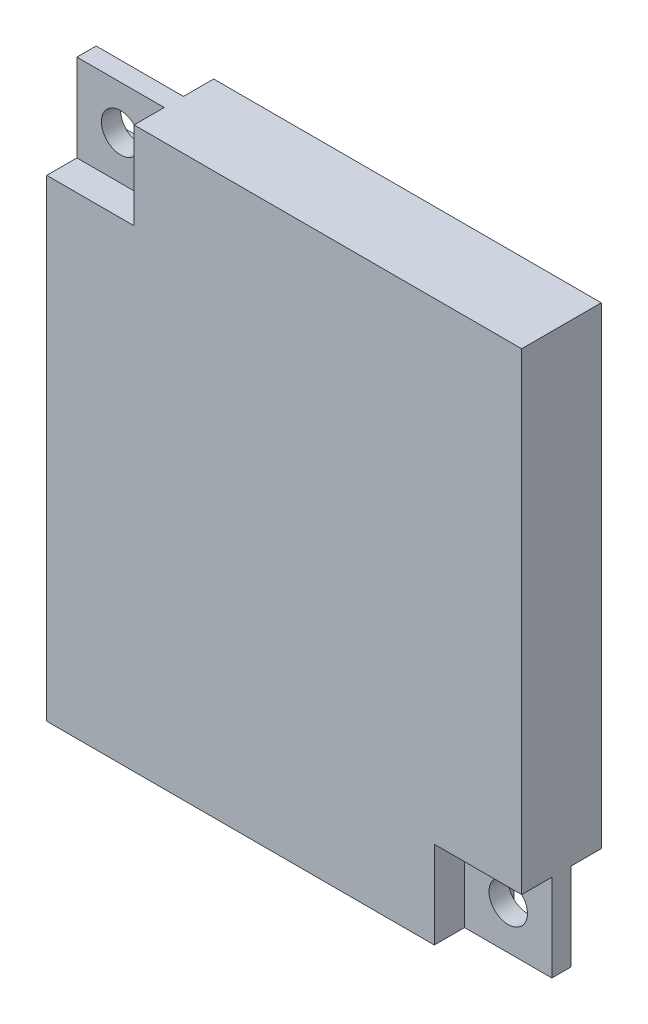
ISO-10303-21;
HEADER;
FILE_DESCRIPTION(('STEP AP214'),'2;1');
FILE_NAME('part.step','',(''),(''),'','','');
FILE_SCHEMA(('AUTOMOTIVE_DESIGN { 1 0 10303 214 1 1 1 1 }'));
ENDSEC;
DATA;
#1=APPLICATION_CONTEXT('core data for automotive mechanical design processes');
#2=APPLICATION_PROTOCOL_DEFINITION('international standard','automotive_design',2000,#1);
#3=PRODUCT_CONTEXT('',#1,'mechanical');
#4=PRODUCT('Part','Part','',(#3));
#5=PRODUCT_RELATED_PRODUCT_CATEGORY('part','',(#4));
#6=PRODUCT_DEFINITION_FORMATION('','',#4);
#7=PRODUCT_DEFINITION_CONTEXT('part definition',#1,'design');
#8=PRODUCT_DEFINITION('design','',#6,#7);
#9=PRODUCT_DEFINITION_SHAPE('','',#8);
#10=(LENGTH_UNIT() NAMED_UNIT(*) SI_UNIT(.MILLI.,.METRE.));
#11=(NAMED_UNIT(*) PLANE_ANGLE_UNIT() SI_UNIT($,.RADIAN.));
#12=(NAMED_UNIT(*) SI_UNIT($,.STERADIAN.) SOLID_ANGLE_UNIT());
#13=UNCERTAINTY_MEASURE_WITH_UNIT(LENGTH_MEASURE(1.E-05),#10,'distance_accuracy_value','');
#14=(GEOMETRIC_REPRESENTATION_CONTEXT(3) GLOBAL_UNCERTAINTY_ASSIGNED_CONTEXT((#13)) GLOBAL_UNIT_ASSIGNED_CONTEXT((#10,
#11,#12)) REPRESENTATION_CONTEXT('',''));
#15=CARTESIAN_POINT('',(0.,0.,0.));
#16=DIRECTION('',(0.,0.,1.));
#17=DIRECTION('',(1.,0.,0.));
#18=AXIS2_PLACEMENT_3D('',#15,#16,#17);
#19=CARTESIAN_POINT('',(0.,0.,0.));
#20=DIRECTION('',(0.,0.,1.));
#21=DIRECTION('',(1.,0.,0.));
#22=AXIS2_PLACEMENT_3D('',#19,#20,#21);
#23=PLANE('',#22);
#24=DIRECTION('',(-1.,0.,0.));
#25=VECTOR('',#24,1.);
#26=CARTESIAN_POINT('',(-21.971,10.5156,0.));
#27=LINE('',#26,#25);
#28=CARTESIAN_POINT('',(-17.78,10.5156,0.));
#29=VERTEX_POINT('',#28);
#30=CARTESIAN_POINT('',(-21.971,10.5156,0.));
#31=VERTEX_POINT('',#30);
#32=EDGE_CURVE('E231',#29,#31,#27,.T.);
#33=ORIENTED_EDGE('',*,*,#32,.F.);
#34=DIRECTION('',(0.,1.,0.));
#35=VECTOR('',#34,1.);
#36=CARTESIAN_POINT('',(-17.78,10.5156,0.));
#37=LINE('',#36,#35);
#38=CARTESIAN_POINT('',(-17.78,0.,0.));
#39=VERTEX_POINT('',#38);
#40=EDGE_CURVE('E225',#39,#29,#37,.T.);
#41=ORIENTED_EDGE('',*,*,#40,.F.);
#42=DIRECTION('',(1.,0.,0.));
#43=VECTOR('',#42,1.);
#44=CARTESIAN_POINT('',(0.,0.,0.));
#45=LINE('',#44,#43);
#46=CARTESIAN_POINT('',(-21.971,0.,0.));
#47=VERTEX_POINT('',#46);
#48=EDGE_CURVE('E340',#47,#39,#45,.T.);
#49=ORIENTED_EDGE('',*,*,#48,.F.);
#50=DIRECTION('',(0.,-1.,0.));
#51=VECTOR('',#50,1.);
#52=CARTESIAN_POINT('',(-21.971,0.,0.));
#53=LINE('',#52,#51);
#54=EDGE_CURVE('E353',#31,#47,#53,.T.);
#55=ORIENTED_EDGE('',*,*,#54,.F.);
#56=EDGE_LOOP('',(#33,#41,#49,#55));
#57=FACE_BOUND('',#56,.T.);
#58=DIRECTION('',(0.,1.,0.));
#59=VECTOR('',#58,1.);
#60=CARTESIAN_POINT('',(-21.336,2.032,0.));
#61=LINE('',#60,#59);
#62=CARTESIAN_POINT('',(-21.336,2.032,0.));
#63=VERTEX_POINT('',#62);
#64=CARTESIAN_POINT('',(-21.336,10.033,0.));
#65=VERTEX_POINT('',#64);
#66=EDGE_CURVE('E181',#63,#65,#61,.T.);
#67=ORIENTED_EDGE('',*,*,#66,.F.);
#68=DIRECTION('',(-1.,0.,0.));
#69=VECTOR('',#68,1.);
#70=CARTESIAN_POINT('',(-21.336,2.032,0.));
#71=LINE('',#70,#69);
#72=CARTESIAN_POINT('',(-18.3134,2.032,0.));
#73=VERTEX_POINT('',#72);
#74=EDGE_CURVE('E183',#73,#63,#71,.T.);
#75=ORIENTED_EDGE('',*,*,#74,.F.);
#76=DIRECTION('',(0.,-1.,0.));
#77=VECTOR('',#76,1.);
#78=CARTESIAN_POINT('',(-18.3134,2.032,0.));
#79=LINE('',#78,#77);
#80=CARTESIAN_POINT('',(-18.3134,10.033,0.));
#81=VERTEX_POINT('',#80);
#82=EDGE_CURVE('E51',#81,#73,#79,.T.);
#83=ORIENTED_EDGE('',*,*,#82,.F.);
#84=DIRECTION('',(1.,0.,0.));
#85=VECTOR('',#84,1.);
#86=CARTESIAN_POINT('',(-21.336,10.033,0.));
#87=LINE('',#86,#85);
#88=EDGE_CURVE('E46',#65,#81,#87,.T.);
#89=ORIENTED_EDGE('',*,*,#88,.F.);
#90=EDGE_LOOP('',(#67,#75,#83,#89));
#91=FACE_BOUND('',#90,.T.);
#92=ADVANCED_FACE('F29',(#57,#91),#23,.F.);
#93=CARTESIAN_POINT('',(-2.0193,2.0193,0.));
#94=DIRECTION('',(0.,0.,1.));
#95=DIRECTION('',(1.,0.,0.));
#96=AXIS2_PLACEMENT_3D('',#93,#94,#95);
#97=CIRCLE('',#96,0.889);
#98=CARTESIAN_POINT('',(-1.1303,2.0193,0.));
#99=VERTEX_POINT('',#98);
#100=EDGE_CURVE('E216',#99,#99,#97,.T.);
#101=ORIENTED_EDGE('',*,*,#100,.T.);
#102=EDGE_LOOP('',(#101));
#103=FACE_BOUND('',#102,.T.);
#104=DIRECTION('',(0.,-1.,0.));
#105=VECTOR('',#104,1.);
#106=CARTESIAN_POINT('',(-4.0386,0.,0.));
#107=LINE('',#106,#105);
#108=CARTESIAN_POINT('',(-4.0386,4.0386,0.));
#109=VERTEX_POINT('',#108);
#110=CARTESIAN_POINT('',(-4.03859999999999,0.,0.));
#111=VERTEX_POINT('',#110);
#112=EDGE_CURVE('E278',#109,#111,#107,.T.);
#113=ORIENTED_EDGE('',*,*,#112,.F.);
#114=DIRECTION('',(-1.,0.,0.));
#115=VECTOR('',#114,1.);
#116=CARTESIAN_POINT('',(-4.0386,4.0386,0.));
#117=LINE('',#116,#115);
#118=CARTESIAN_POINT('',(0.,4.0386,0.));
#119=VERTEX_POINT('',#118);
#120=EDGE_CURVE('E268',#119,#109,#117,.T.);
#121=ORIENTED_EDGE('',*,*,#120,.F.);
#122=DIRECTION('',(0.,1.,0.));
#123=VECTOR('',#122,1.);
#124=CARTESIAN_POINT('',(0.,0.,0.));
#125=LINE('',#124,#123);
#126=CARTESIAN_POINT('',(0.,0.,0.));
#127=VERTEX_POINT('',#126);
#128=EDGE_CURVE('E334',#127,#119,#125,.T.);
#129=ORIENTED_EDGE('',*,*,#128,.F.);
#130=EDGE_CURVE('E465',#111,#127,#45,.T.);
#131=ORIENTED_EDGE('',*,*,#130,.F.);
#132=EDGE_LOOP('',(#113,#121,#129,#131));
#133=FACE_BOUND('',#132,.T.);
#134=ADVANCED_FACE('F488',(#103,#133),#23,.F.);
#135=CARTESIAN_POINT('',(-19.9517,23.8887,0.));
#136=DIRECTION('',(0.,0.,1.));
#137=DIRECTION('',(1.,0.,0.));
#138=AXIS2_PLACEMENT_3D('',#135,#136,#137);
#139=CIRCLE('',#138,0.889);
#140=CARTESIAN_POINT('',(-19.0627,23.8887,0.));
#141=VERTEX_POINT('',#140);
#142=EDGE_CURVE('E222',#141,#141,#139,.T.);
#143=ORIENTED_EDGE('',*,*,#142,.T.);
#144=EDGE_LOOP('',(#143));
#145=FACE_BOUND('',#144,.T.);
#146=DIRECTION('',(0.,1.,0.));
#147=VECTOR('',#146,1.);
#148=CARTESIAN_POINT('',(-17.9324,25.908,0.));
#149=LINE('',#148,#147);
#150=CARTESIAN_POINT('',(-17.9324,21.8694,0.));
#151=VERTEX_POINT('',#150);
#152=CARTESIAN_POINT('',(-17.9324,25.908,0.));
#153=VERTEX_POINT('',#152);
#154=EDGE_CURVE('E260',#151,#153,#149,.T.);
#155=ORIENTED_EDGE('',*,*,#154,.F.);
#156=DIRECTION('',(1.,0.,0.));
#157=VECTOR('',#156,1.);
#158=CARTESIAN_POINT('',(-17.9324,21.8694,0.));
#159=LINE('',#158,#157);
#160=CARTESIAN_POINT('',(-21.971,21.8694,0.));
#161=VERTEX_POINT('',#160);
#162=EDGE_CURVE('E234',#161,#151,#159,.T.);
#163=ORIENTED_EDGE('',*,*,#162,.F.);
#164=CARTESIAN_POINT('',(-21.971,25.908,0.));
#165=VERTEX_POINT('',#164);
#166=EDGE_CURVE('E461',#165,#161,#53,.T.);
#167=ORIENTED_EDGE('',*,*,#166,.F.);
#168=DIRECTION('',(-1.,0.,0.));
#169=VECTOR('',#168,1.);
#170=CARTESIAN_POINT('',(0.,25.908,0.));
#171=LINE('',#170,#169);
#172=EDGE_CURVE('E338',#153,#165,#171,.T.);
#173=ORIENTED_EDGE('',*,*,#172,.F.);
#174=EDGE_LOOP('',(#155,#163,#167,#173));
#175=FACE_BOUND('',#174,.T.);
#176=ADVANCED_FACE('F464',(#145,#175),#23,.F.);
#177=CARTESIAN_POINT('',(0.,0.,0.889));
#178=DIRECTION('',(0.,0.,1.));
#179=DIRECTION('',(1.,0.,0.));
#180=AXIS2_PLACEMENT_3D('',#177,#178,#179);
#181=PLANE('',#180);
#182=CARTESIAN_POINT('',(-2.0193,2.0193,0.889));
#183=DIRECTION('',(0.,0.,1.));
#184=DIRECTION('',(1.,0.,0.));
#185=AXIS2_PLACEMENT_3D('',#182,#183,#184);
#186=CIRCLE('',#185,0.889);
#187=CARTESIAN_POINT('',(-1.1303,2.0193,0.889));
#188=VERTEX_POINT('',#187);
#189=EDGE_CURVE('E213',#188,#188,#186,.T.);
#190=ORIENTED_EDGE('',*,*,#189,.F.);
#191=EDGE_LOOP('',(#190));
#192=FACE_BOUND('',#191,.T.);
#193=DIRECTION('',(1.,0.,0.));
#194=VECTOR('',#193,1.);
#195=CARTESIAN_POINT('',(-4.0386,4.0386,0.889));
#196=LINE('',#195,#194);
#197=CARTESIAN_POINT('',(-4.0386,4.0386,0.889));
#198=VERTEX_POINT('',#197);
#199=CARTESIAN_POINT('',(0.,4.0386,0.889));
#200=VERTEX_POINT('',#199);
#201=EDGE_CURVE('E377',#198,#200,#196,.T.);
#202=ORIENTED_EDGE('',*,*,#201,.F.);
#203=DIRECTION('',(0.,1.,0.));
#204=VECTOR('',#203,1.);
#205=CARTESIAN_POINT('',(-4.0386,0.,0.889));
#206=LINE('',#205,#204);
#207=CARTESIAN_POINT('',(-4.0386,0.,0.889));
#208=VERTEX_POINT('',#207);
#209=EDGE_CURVE('E323',#208,#198,#206,.T.);
#210=ORIENTED_EDGE('',*,*,#209,.F.);
#211=DIRECTION('',(1.,0.,0.));
#212=VECTOR('',#211,1.);
#213=CARTESIAN_POINT('',(0.,0.,0.889));
#214=LINE('',#213,#212);
#215=CARTESIAN_POINT('',(0.,0.,0.889));
#216=VERTEX_POINT('',#215);
#217=EDGE_CURVE('E369',#208,#216,#214,.T.);
#218=ORIENTED_EDGE('',*,*,#217,.T.);
#219=DIRECTION('',(0.,1.,0.));
#220=VECTOR('',#219,1.);
#221=CARTESIAN_POINT('',(0.,0.,0.889));
#222=LINE('',#221,#220);
#223=EDGE_CURVE('E474',#216,#200,#222,.T.);
#224=ORIENTED_EDGE('',*,*,#223,.T.);
#225=EDGE_LOOP('',(#202,#210,#218,#224));
#226=FACE_BOUND('',#225,.T.);
#227=ADVANCED_FACE('F484',(#192,#226),#181,.T.);
#228=CARTESIAN_POINT('',(0.,0.,0.889));
#229=DIRECTION('',(-1.,0.,0.));
#230=DIRECTION('',(0.,0.,1.));
#231=AXIS2_PLACEMENT_3D('',#228,#229,#230);
#232=PLANE('',#231);
#233=ORIENTED_EDGE('',*,*,#128,.T.);
#234=DIRECTION('',(0.,0.,1.));
#235=VECTOR('',#234,1.);
#236=CARTESIAN_POINT('',(0.,4.0386,-1.397));
#237=LINE('',#236,#235);
#238=CARTESIAN_POINT('',(0.,4.0386,-1.397));
#239=VERTEX_POINT('',#238);
#240=EDGE_CURVE('E265',#239,#119,#237,.T.);
#241=ORIENTED_EDGE('',*,*,#240,.F.);
#242=DIRECTION('',(0.,-1.,0.));
#243=VECTOR('',#242,1.);
#244=CARTESIAN_POINT('',(0.,4.0386,-1.397));
#245=LINE('',#244,#243);
#246=CARTESIAN_POINT('',(0.,25.908,-1.397));
#247=VERTEX_POINT('',#246);
#248=EDGE_CURVE('E307',#247,#239,#245,.T.);
#249=ORIENTED_EDGE('',*,*,#248,.F.);
#250=DIRECTION('',(0.,0.,-1.));
#251=VECTOR('',#250,1.);
#252=CARTESIAN_POINT('',(0.,25.908,0.889));
#253=LINE('',#252,#251);
#254=CARTESIAN_POINT('',(0.,25.908,2.286));
#255=VERTEX_POINT('',#254);
#256=EDGE_CURVE('E11',#255,#247,#253,.T.);
#257=ORIENTED_EDGE('',*,*,#256,.F.);
#258=DIRECTION('',(0.,1.,0.));
#259=VECTOR('',#258,1.);
#260=CARTESIAN_POINT('',(0.,4.0386,2.286));
#261=LINE('',#260,#259);
#262=CARTESIAN_POINT('',(0.,4.0386,2.286));
#263=VERTEX_POINT('',#262);
#264=EDGE_CURVE('E385',#263,#255,#261,.T.);
#265=ORIENTED_EDGE('',*,*,#264,.F.);
#266=DIRECTION('',(0.,0.,-1.));
#267=VECTOR('',#266,1.);
#268=CARTESIAN_POINT('',(0.,4.0386,2.286));
#269=LINE('',#268,#267);
#270=EDGE_CURVE('E381',#263,#200,#269,.T.);
#271=ORIENTED_EDGE('',*,*,#270,.T.);
#272=ORIENTED_EDGE('',*,*,#223,.F.);
#273=DIRECTION('',(0.,0.,-1.));
#274=VECTOR('',#273,1.);
#275=CARTESIAN_POINT('',(0.,0.,0.889));
#276=LINE('',#275,#274);
#277=EDGE_CURVE('E479',#216,#127,#276,.T.);
#278=ORIENTED_EDGE('',*,*,#277,.T.);
#279=EDGE_LOOP('',(#233,#241,#249,#257,#265,#271,#272,#278));
#280=FACE_BOUND('',#279,.T.);
#281=ADVANCED_FACE('F31',(#280),#232,.F.);
#282=CARTESIAN_POINT('',(0.,25.908,0.889));
#283=DIRECTION('',(0.,-1.,0.));
#284=DIRECTION('',(1.,0.,0.));
#285=AXIS2_PLACEMENT_3D('',#282,#283,#284);
#286=PLANE('',#285);
#287=ORIENTED_EDGE('',*,*,#256,.T.);
#288=DIRECTION('',(1.,0.,0.));
#289=VECTOR('',#288,1.);
#290=CARTESIAN_POINT('',(0.,25.908,-1.397));
#291=LINE('',#290,#289);
#292=CARTESIAN_POINT('',(-17.9324,25.908,-1.397));
#293=VERTEX_POINT('',#292);
#294=EDGE_CURVE('E304',#293,#247,#291,.T.);
#295=ORIENTED_EDGE('',*,*,#294,.F.);
#296=DIRECTION('',(0.,0.,1.));
#297=VECTOR('',#296,1.);
#298=CARTESIAN_POINT('',(-17.9324,25.908,-1.397));
#299=LINE('',#298,#297);
#300=EDGE_CURVE('E254',#293,#153,#299,.T.);
#301=ORIENTED_EDGE('',*,*,#300,.T.);
#302=ORIENTED_EDGE('',*,*,#172,.T.);
#303=DIRECTION('',(0.,0.,-1.));
#304=VECTOR('',#303,1.);
#305=CARTESIAN_POINT('',(-21.971,25.908,0.889));
#306=LINE('',#305,#304);
#307=CARTESIAN_POINT('',(-21.971,25.908,0.889));
#308=VERTEX_POINT('',#307);
#309=EDGE_CURVE('E38',#308,#165,#306,.T.);
#310=ORIENTED_EDGE('',*,*,#309,.F.);
#311=DIRECTION('',(-1.,0.,0.));
#312=VECTOR('',#311,1.);
#313=CARTESIAN_POINT('',(0.,25.908,0.889));
#314=LINE('',#313,#312);
#315=CARTESIAN_POINT('',(-17.9324,25.908,0.889));
#316=VERTEX_POINT('',#315);
#317=EDGE_CURVE('E424',#316,#308,#314,.T.);
#318=ORIENTED_EDGE('',*,*,#317,.F.);
#319=DIRECTION('',(0.,0.,-1.));
#320=VECTOR('',#319,1.);
#321=CARTESIAN_POINT('',(-17.9324,25.908,2.286));
#322=LINE('',#321,#320);
#323=CARTESIAN_POINT('',(-17.9324,25.908,2.286));
#324=VERTEX_POINT('',#323);
#325=EDGE_CURVE('E339',#324,#316,#322,.T.);
#326=ORIENTED_EDGE('',*,*,#325,.F.);
#327=DIRECTION('',(-1.,0.,0.));
#328=VECTOR('',#327,1.);
#329=CARTESIAN_POINT('',(0.,25.908,2.286));
#330=LINE('',#329,#328);
#331=EDGE_CURVE('E380',#255,#324,#330,.T.);
#332=ORIENTED_EDGE('',*,*,#331,.F.);
#333=EDGE_LOOP('',(#287,#295,#301,#302,#310,#318,#326,#332));
#334=FACE_BOUND('',#333,.T.);
#335=ADVANCED_FACE('F422',(#334),#286,.F.);
#336=CARTESIAN_POINT('',(-21.971,0.,0.889));
#337=DIRECTION('',(1.,0.,0.));
#338=DIRECTION('',(0.,0.,-1.));
#339=AXIS2_PLACEMENT_3D('',#336,#337,#338);
#340=PLANE('',#339);
#341=ORIENTED_EDGE('',*,*,#166,.T.);
#342=DIRECTION('',(0.,0.,1.));
#343=VECTOR('',#342,1.);
#344=CARTESIAN_POINT('',(-21.971,21.8694,-1.397));
#345=LINE('',#344,#343);
#346=CARTESIAN_POINT('',(-21.971,21.8694,-1.397));
#347=VERTEX_POINT('',#346);
#348=EDGE_CURVE('E240',#347,#161,#345,.T.);
#349=ORIENTED_EDGE('',*,*,#348,.F.);
#350=DIRECTION('',(0.,1.,0.));
#351=VECTOR('',#350,1.);
#352=CARTESIAN_POINT('',(-21.971,21.8694,-1.397));
#353=LINE('',#352,#351);
#354=CARTESIAN_POINT('',(-21.971,10.5156,-1.397));
#355=VERTEX_POINT('',#354);
#356=EDGE_CURVE('E298',#355,#347,#353,.T.);
#357=ORIENTED_EDGE('',*,*,#356,.F.);
#358=DIRECTION('',(0.,0.,1.));
#359=VECTOR('',#358,1.);
#360=CARTESIAN_POINT('',(-21.971,10.5156,-1.397));
#361=LINE('',#360,#359);
#362=EDGE_CURVE('E237',#355,#31,#361,.T.);
#363=ORIENTED_EDGE('',*,*,#362,.T.);
#364=ORIENTED_EDGE('',*,*,#54,.T.);
#365=DIRECTION('',(0.,0.,-1.));
#366=VECTOR('',#365,1.);
#367=CARTESIAN_POINT('',(-21.971,0.,0.889));
#368=LINE('',#367,#366);
#369=CARTESIAN_POINT('',(-21.971,0.,2.286));
#370=VERTEX_POINT('',#369);
#371=EDGE_CURVE('E436',#370,#47,#368,.T.);
#372=ORIENTED_EDGE('',*,*,#371,.F.);
#373=DIRECTION('',(0.,-1.,0.));
#374=VECTOR('',#373,1.);
#375=CARTESIAN_POINT('',(-21.971,21.8694,2.286));
#376=LINE('',#375,#374);
#377=CARTESIAN_POINT('',(-21.971,21.8694,2.286));
#378=VERTEX_POINT('',#377);
#379=EDGE_CURVE('E408',#378,#370,#376,.T.);
#380=ORIENTED_EDGE('',*,*,#379,.F.);
#381=DIRECTION('',(0.,0.,-1.));
#382=VECTOR('',#381,1.);
#383=CARTESIAN_POINT('',(-21.971,21.8694,2.286));
#384=LINE('',#383,#382);
#385=CARTESIAN_POINT('',(-21.971,21.8694,0.889));
#386=VERTEX_POINT('',#385);
#387=EDGE_CURVE('E327',#378,#386,#384,.T.);
#388=ORIENTED_EDGE('',*,*,#387,.T.);
#389=DIRECTION('',(0.,-1.,0.));
#390=VECTOR('',#389,1.);
#391=CARTESIAN_POINT('',(-21.971,0.,0.889));
#392=LINE('',#391,#390);
#393=EDGE_CURVE('E462',#308,#386,#392,.T.);
#394=ORIENTED_EDGE('',*,*,#393,.F.);
#395=ORIENTED_EDGE('',*,*,#309,.T.);
#396=EDGE_LOOP('',(#341,#349,#357,#363,#364,#372,#380,#388,#394,#395));
#397=FACE_BOUND('',#396,.T.);
#398=ADVANCED_FACE('F460',(#397),#340,.F.);
#399=CARTESIAN_POINT('',(0.,0.,0.889));
#400=DIRECTION('',(0.,1.,0.));
#401=DIRECTION('',(-1.,0.,0.));
#402=AXIS2_PLACEMENT_3D('',#399,#400,#401);
#403=PLANE('',#402);
#404=ORIENTED_EDGE('',*,*,#48,.T.);
#405=DIRECTION('',(0.,0.,1.));
#406=VECTOR('',#405,1.);
#407=CARTESIAN_POINT('',(-17.78,0.,-1.397));
#408=LINE('',#407,#406);
#409=CARTESIAN_POINT('',(-17.78,0.,-1.397));
#410=VERTEX_POINT('',#409);
#411=EDGE_CURVE('E245',#410,#39,#408,.T.);
#412=ORIENTED_EDGE('',*,*,#411,.F.);
#413=DIRECTION('',(-1.,0.,0.));
#414=VECTOR('',#413,1.);
#415=CARTESIAN_POINT('',(-17.78,0.,-1.397));
#416=LINE('',#415,#414);
#417=CARTESIAN_POINT('',(-4.0386,0.,-1.397));
#418=VERTEX_POINT('',#417);
#419=EDGE_CURVE('E287',#418,#410,#416,.T.);
#420=ORIENTED_EDGE('',*,*,#419,.F.);
#421=DIRECTION('',(0.,0.,1.));
#422=VECTOR('',#421,1.);
#423=CARTESIAN_POINT('',(-4.0386,0.,-1.397));
#424=LINE('',#423,#422);
#425=EDGE_CURVE('E281',#418,#111,#424,.T.);
#426=ORIENTED_EDGE('',*,*,#425,.T.);
#427=ORIENTED_EDGE('',*,*,#130,.T.);
#428=ORIENTED_EDGE('',*,*,#277,.F.);
#429=ORIENTED_EDGE('',*,*,#217,.F.);
#430=DIRECTION('',(0.,0.,-1.));
#431=VECTOR('',#430,1.);
#432=CARTESIAN_POINT('',(-4.0386,0.,2.286));
#433=LINE('',#432,#431);
#434=CARTESIAN_POINT('',(-4.0386,0.,2.286));
#435=VERTEX_POINT('',#434);
#436=EDGE_CURVE('E331',#435,#208,#433,.T.);
#437=ORIENTED_EDGE('',*,*,#436,.F.);
#438=DIRECTION('',(1.,0.,0.));
#439=VECTOR('',#438,1.);
#440=CARTESIAN_POINT('',(-21.971,0.,2.286));
#441=LINE('',#440,#439);
#442=EDGE_CURVE('E406',#370,#435,#441,.T.);
#443=ORIENTED_EDGE('',*,*,#442,.F.);
#444=ORIENTED_EDGE('',*,*,#371,.T.);
#445=EDGE_LOOP('',(#404,#412,#420,#426,#427,#428,#429,#437,#443,#444));
#446=FACE_BOUND('',#445,.T.);
#447=ADVANCED_FACE('F435',(#446),#403,.F.);
#448=CARTESIAN_POINT('',(-19.9517,23.8887,0.889));
#449=DIRECTION('',(0.,0.,1.));
#450=DIRECTION('',(1.,0.,0.));
#451=AXIS2_PLACEMENT_3D('',#448,#449,#450);
#452=CIRCLE('',#451,0.889);
#453=CARTESIAN_POINT('',(-19.0627,23.8887,0.889));
#454=VERTEX_POINT('',#453);
#455=EDGE_CURVE('E219',#454,#454,#452,.T.);
#456=ORIENTED_EDGE('',*,*,#455,.F.);
#457=EDGE_LOOP('',(#456));
#458=FACE_BOUND('',#457,.T.);
#459=DIRECTION('',(-1.,0.,0.));
#460=VECTOR('',#459,1.);
#461=CARTESIAN_POINT('',(-17.9324,21.8694,0.889));
#462=LINE('',#461,#460);
#463=CARTESIAN_POINT('',(-17.9324,21.8694,0.889));
#464=VERTEX_POINT('',#463);
#465=EDGE_CURVE('E319',#464,#386,#462,.T.);
#466=ORIENTED_EDGE('',*,*,#465,.F.);
#467=DIRECTION('',(0.,-1.,0.));
#468=VECTOR('',#467,1.);
#469=CARTESIAN_POINT('',(-17.9324,25.908,0.889));
#470=LINE('',#469,#468);
#471=EDGE_CURVE('E324',#316,#464,#470,.T.);
#472=ORIENTED_EDGE('',*,*,#471,.F.);
#473=ORIENTED_EDGE('',*,*,#317,.T.);
#474=ORIENTED_EDGE('',*,*,#393,.T.);
#475=EDGE_LOOP('',(#466,#472,#473,#474));
#476=FACE_BOUND('',#475,.T.);
#477=ADVANCED_FACE('F527',(#458,#476),#181,.T.);
#478=CARTESIAN_POINT('',(-17.9324,25.908,2.286));
#479=DIRECTION('',(1.,0.,0.));
#480=DIRECTION('',(0.,0.,-1.));
#481=AXIS2_PLACEMENT_3D('',#478,#479,#480);
#482=PLANE('',#481);
#483=ORIENTED_EDGE('',*,*,#471,.T.);
#484=DIRECTION('',(0.,0.,-1.));
#485=VECTOR('',#484,1.);
#486=CARTESIAN_POINT('',(-17.9324,21.8694,2.286));
#487=LINE('',#486,#485);
#488=CARTESIAN_POINT('',(-17.9324,21.8694,2.286));
#489=VERTEX_POINT('',#488);
#490=EDGE_CURVE('E330',#489,#464,#487,.T.);
#491=ORIENTED_EDGE('',*,*,#490,.F.);
#492=DIRECTION('',(0.,-1.,0.));
#493=VECTOR('',#492,1.);
#494=CARTESIAN_POINT('',(-17.9324,25.908,2.286));
#495=LINE('',#494,#493);
#496=EDGE_CURVE('E413',#324,#489,#495,.T.);
#497=ORIENTED_EDGE('',*,*,#496,.F.);
#498=ORIENTED_EDGE('',*,*,#325,.T.);
#499=EDGE_LOOP('',(#483,#491,#497,#498));
#500=FACE_BOUND('',#499,.T.);
#501=ADVANCED_FACE('F425',(#500),#482,.F.);
#502=CARTESIAN_POINT('',(-17.9324,21.8694,2.286));
#503=DIRECTION('',(0.,-1.,0.));
#504=DIRECTION('',(0.,0.,-1.));
#505=AXIS2_PLACEMENT_3D('',#502,#503,#504);
#506=PLANE('',#505);
#507=ORIENTED_EDGE('',*,*,#465,.T.);
#508=ORIENTED_EDGE('',*,*,#387,.F.);
#509=DIRECTION('',(-1.,0.,0.));
#510=VECTOR('',#509,1.);
#511=CARTESIAN_POINT('',(-17.9324,21.8694,2.286));
#512=LINE('',#511,#510);
#513=EDGE_CURVE('E411',#489,#378,#512,.T.);
#514=ORIENTED_EDGE('',*,*,#513,.F.);
#515=ORIENTED_EDGE('',*,*,#490,.T.);
#516=EDGE_LOOP('',(#507,#508,#514,#515));
#517=FACE_BOUND('',#516,.T.);
#518=ADVANCED_FACE('F429',(#517),#506,.F.);
#519=CARTESIAN_POINT('',(-4.0386,0.,2.286));
#520=DIRECTION('',(-1.,0.,0.));
#521=DIRECTION('',(0.,0.,1.));
#522=AXIS2_PLACEMENT_3D('',#519,#520,#521);
#523=PLANE('',#522);
#524=ORIENTED_EDGE('',*,*,#209,.T.);
#525=DIRECTION('',(0.,0.,-1.));
#526=VECTOR('',#525,1.);
#527=CARTESIAN_POINT('',(-4.0386,4.0386,2.286));
#528=LINE('',#527,#526);
#529=CARTESIAN_POINT('',(-4.0386,4.0386,2.286));
#530=VERTEX_POINT('',#529);
#531=EDGE_CURVE('E384',#530,#198,#528,.T.);
#532=ORIENTED_EDGE('',*,*,#531,.F.);
#533=DIRECTION('',(0.,1.,0.));
#534=VECTOR('',#533,1.);
#535=CARTESIAN_POINT('',(-4.0386,0.,2.286));
#536=LINE('',#535,#534);
#537=EDGE_CURVE('E404',#435,#530,#536,.T.);
#538=ORIENTED_EDGE('',*,*,#537,.F.);
#539=ORIENTED_EDGE('',*,*,#436,.T.);
#540=EDGE_LOOP('',(#524,#532,#538,#539));
#541=FACE_BOUND('',#540,.T.);
#542=ADVANCED_FACE('F440',(#541),#523,.F.);
#543=CARTESIAN_POINT('',(-4.0386,4.0386,2.286));
#544=DIRECTION('',(0.,1.,0.));
#545=DIRECTION('',(0.,0.,1.));
#546=AXIS2_PLACEMENT_3D('',#543,#544,#545);
#547=PLANE('',#546);
#548=ORIENTED_EDGE('',*,*,#201,.T.);
#549=ORIENTED_EDGE('',*,*,#270,.F.);
#550=DIRECTION('',(1.,0.,0.));
#551=VECTOR('',#550,1.);
#552=CARTESIAN_POINT('',(-4.0386,4.0386,2.286));
#553=LINE('',#552,#551);
#554=EDGE_CURVE('E402',#530,#263,#553,.T.);
#555=ORIENTED_EDGE('',*,*,#554,.F.);
#556=ORIENTED_EDGE('',*,*,#531,.T.);
#557=EDGE_LOOP('',(#548,#549,#555,#556));
#558=FACE_BOUND('',#557,.T.);
#559=ADVANCED_FACE('F442',(#558),#547,.F.);
#560=CARTESIAN_POINT('',(-17.9324,25.908,2.286));
#561=DIRECTION('',(0.,0.,1.));
#562=DIRECTION('',(1.,0.,0.));
#563=AXIS2_PLACEMENT_3D('',#560,#561,#562);
#564=PLANE('',#563);
#565=ORIENTED_EDGE('',*,*,#331,.T.);
#566=ORIENTED_EDGE('',*,*,#496,.T.);
#567=ORIENTED_EDGE('',*,*,#513,.T.);
#568=ORIENTED_EDGE('',*,*,#379,.T.);
#569=ORIENTED_EDGE('',*,*,#442,.T.);
#570=ORIENTED_EDGE('',*,*,#537,.T.);
#571=ORIENTED_EDGE('',*,*,#554,.T.);
#572=ORIENTED_EDGE('',*,*,#264,.T.);
#573=EDGE_LOOP('',(#565,#566,#567,#568,#569,#570,#571,#572));
#574=FACE_BOUND('',#573,.T.);
#575=ADVANCED_FACE('F418',(#574),#564,.T.);
#576=CARTESIAN_POINT('',(-17.78,10.5156,-1.397));
#577=DIRECTION('',(1.,0.,0.));
#578=DIRECTION('',(0.,0.,-1.));
#579=AXIS2_PLACEMENT_3D('',#576,#577,#578);
#580=PLANE('',#579);
#581=ORIENTED_EDGE('',*,*,#40,.T.);
#582=DIRECTION('',(0.,0.,1.));
#583=VECTOR('',#582,1.);
#584=CARTESIAN_POINT('',(-17.78,10.5156,-1.397));
#585=LINE('',#584,#583);
#586=CARTESIAN_POINT('',(-17.78,10.5156,-1.397));
#587=VERTEX_POINT('',#586);
#588=EDGE_CURVE('E239',#587,#29,#585,.T.);
#589=ORIENTED_EDGE('',*,*,#588,.F.);
#590=DIRECTION('',(0.,1.,0.));
#591=VECTOR('',#590,1.);
#592=CARTESIAN_POINT('',(-17.78,10.5156,-1.397));
#593=LINE('',#592,#591);
#594=EDGE_CURVE('E294',#410,#587,#593,.T.);
#595=ORIENTED_EDGE('',*,*,#594,.F.);
#596=ORIENTED_EDGE('',*,*,#411,.T.);
#597=EDGE_LOOP('',(#581,#589,#595,#596));
#598=FACE_BOUND('',#597,.T.);
#599=ADVANCED_FACE('F498',(#598),#580,.F.);
#600=CARTESIAN_POINT('',(-21.971,10.5156,-1.397));
#601=DIRECTION('',(0.,1.,0.));
#602=DIRECTION('',(-1.,0.,0.));
#603=AXIS2_PLACEMENT_3D('',#600,#601,#602);
#604=PLANE('',#603);
#605=ORIENTED_EDGE('',*,*,#32,.T.);
#606=ORIENTED_EDGE('',*,*,#362,.F.);
#607=DIRECTION('',(-1.,0.,0.));
#608=VECTOR('',#607,1.);
#609=CARTESIAN_POINT('',(-21.971,10.5156,-1.397));
#610=LINE('',#609,#608);
#611=EDGE_CURVE('E296',#587,#355,#610,.T.);
#612=ORIENTED_EDGE('',*,*,#611,.F.);
#613=ORIENTED_EDGE('',*,*,#588,.T.);
#614=EDGE_LOOP('',(#605,#606,#612,#613));
#615=FACE_BOUND('',#614,.T.);
#616=ADVANCED_FACE('F501',(#615),#604,.F.);
#617=CARTESIAN_POINT('',(-17.9324,21.8694,-1.397));
#618=DIRECTION('',(0.,-1.,0.));
#619=DIRECTION('',(0.,0.,-1.));
#620=AXIS2_PLACEMENT_3D('',#617,#618,#619);
#621=PLANE('',#620);
#622=ORIENTED_EDGE('',*,*,#162,.T.);
#623=DIRECTION('',(0.,0.,1.));
#624=VECTOR('',#623,1.);
#625=CARTESIAN_POINT('',(-17.9324,21.8694,-1.397));
#626=LINE('',#625,#624);
#627=CARTESIAN_POINT('',(-17.9324,21.8694,-1.397));
#628=VERTEX_POINT('',#627);
#629=EDGE_CURVE('E248',#628,#151,#626,.T.);
#630=ORIENTED_EDGE('',*,*,#629,.F.);
#631=DIRECTION('',(1.,0.,0.));
#632=VECTOR('',#631,1.);
#633=CARTESIAN_POINT('',(-17.9324,21.8694,-1.397));
#634=LINE('',#633,#632);
#635=EDGE_CURVE('E300',#347,#628,#634,.T.);
#636=ORIENTED_EDGE('',*,*,#635,.F.);
#637=ORIENTED_EDGE('',*,*,#348,.T.);
#638=EDGE_LOOP('',(#622,#630,#636,#637));
#639=FACE_BOUND('',#638,.T.);
#640=ADVANCED_FACE('F502',(#639),#621,.F.);
#641=CARTESIAN_POINT('',(-17.9324,25.908,-1.397));
#642=DIRECTION('',(1.,0.,0.));
#643=DIRECTION('',(0.,1.,0.));
#644=AXIS2_PLACEMENT_3D('',#641,#642,#643);
#645=PLANE('',#644);
#646=ORIENTED_EDGE('',*,*,#154,.T.);
#647=ORIENTED_EDGE('',*,*,#300,.F.);
#648=DIRECTION('',(0.,1.,0.));
#649=VECTOR('',#648,1.);
#650=CARTESIAN_POINT('',(-17.9324,25.908,-1.397));
#651=LINE('',#650,#649);
#652=EDGE_CURVE('E302',#628,#293,#651,.T.);
#653=ORIENTED_EDGE('',*,*,#652,.F.);
#654=ORIENTED_EDGE('',*,*,#629,.T.);
#655=EDGE_LOOP('',(#646,#647,#653,#654));
#656=FACE_BOUND('',#655,.T.);
#657=ADVANCED_FACE('F454',(#656),#645,.F.);
#658=CARTESIAN_POINT('',(-4.0386,4.0386,-1.397));
#659=DIRECTION('',(0.,1.,0.));
#660=DIRECTION('',(0.,0.,1.));
#661=AXIS2_PLACEMENT_3D('',#658,#659,#660);
#662=PLANE('',#661);
#663=ORIENTED_EDGE('',*,*,#120,.T.);
#664=DIRECTION('',(0.,0.,1.));
#665=VECTOR('',#664,1.);
#666=CARTESIAN_POINT('',(-4.0386,4.0386,-1.397));
#667=LINE('',#666,#665);
#668=CARTESIAN_POINT('',(-4.0386,4.0386,-1.397));
#669=VERTEX_POINT('',#668);
#670=EDGE_CURVE('E273',#669,#109,#667,.T.);
#671=ORIENTED_EDGE('',*,*,#670,.F.);
#672=DIRECTION('',(-1.,0.,0.));
#673=VECTOR('',#672,1.);
#674=CARTESIAN_POINT('',(-4.0386,4.0386,-1.397));
#675=LINE('',#674,#673);
#676=EDGE_CURVE('E309',#239,#669,#675,.T.);
#677=ORIENTED_EDGE('',*,*,#676,.F.);
#678=ORIENTED_EDGE('',*,*,#240,.T.);
#679=EDGE_LOOP('',(#663,#671,#677,#678));
#680=FACE_BOUND('',#679,.T.);
#681=ADVANCED_FACE('F495',(#680),#662,.F.);
#682=CARTESIAN_POINT('',(-4.0386,0.,-1.397));
#683=DIRECTION('',(-1.,0.,0.));
#684=DIRECTION('',(0.,-1.,0.));
#685=AXIS2_PLACEMENT_3D('',#682,#683,#684);
#686=PLANE('',#685);
#687=ORIENTED_EDGE('',*,*,#112,.T.);
#688=ORIENTED_EDGE('',*,*,#425,.F.);
#689=DIRECTION('',(0.,-1.,0.));
#690=VECTOR('',#689,1.);
#691=CARTESIAN_POINT('',(-4.0386,0.,-1.397));
#692=LINE('',#691,#690);
#693=EDGE_CURVE('E284',#669,#418,#692,.T.);
#694=ORIENTED_EDGE('',*,*,#693,.F.);
#695=ORIENTED_EDGE('',*,*,#670,.T.);
#696=EDGE_LOOP('',(#687,#688,#694,#695));
#697=FACE_BOUND('',#696,.T.);
#698=ADVANCED_FACE('F490',(#697),#686,.F.);
#699=CARTESIAN_POINT('',(0.,0.,-1.397));
#700=DIRECTION('',(0.,0.,1.));
#701=DIRECTION('',(1.,0.,0.));
#702=AXIS2_PLACEMENT_3D('',#699,#700,#701);
#703=PLANE('',#702);
#704=ORIENTED_EDGE('',*,*,#419,.T.);
#705=ORIENTED_EDGE('',*,*,#594,.T.);
#706=ORIENTED_EDGE('',*,*,#611,.T.);
#707=ORIENTED_EDGE('',*,*,#356,.T.);
#708=ORIENTED_EDGE('',*,*,#635,.T.);
#709=ORIENTED_EDGE('',*,*,#652,.T.);
#710=ORIENTED_EDGE('',*,*,#294,.T.);
#711=ORIENTED_EDGE('',*,*,#248,.T.);
#712=ORIENTED_EDGE('',*,*,#676,.T.);
#713=ORIENTED_EDGE('',*,*,#693,.T.);
#714=EDGE_LOOP('',(#704,#705,#706,#707,#708,#709,#710,#711,#712,#713));
#715=FACE_BOUND('',#714,.T.);
#716=ADVANCED_FACE('F449',(#715),#703,.F.);
#717=CARTESIAN_POINT('',(-19.9517,23.8887,-1.397025));
#718=DIRECTION('',(0.,0.,1.));
#719=DIRECTION('',(1.,0.,0.));
#720=AXIS2_PLACEMENT_3D('',#717,#718,#719);
#721=CYLINDRICAL_SURFACE('',#720,0.889);
#722=ORIENTED_EDGE('',*,*,#455,.T.);
#723=EDGE_LOOP('',(#722));
#724=FACE_BOUND('',#723,.T.);
#725=ORIENTED_EDGE('',*,*,#142,.F.);
#726=EDGE_LOOP('',(#725));
#727=FACE_BOUND('',#726,.T.);
#728=ADVANCED_FACE('F530',(#724,#727),#721,.F.);
#729=CARTESIAN_POINT('',(-2.0193,2.0193,-1.397025));
#730=DIRECTION('',(0.,0.,1.));
#731=DIRECTION('',(1.,0.,0.));
#732=AXIS2_PLACEMENT_3D('',#729,#730,#731);
#733=CYLINDRICAL_SURFACE('',#732,0.889);
#734=ORIENTED_EDGE('',*,*,#189,.T.);
#735=EDGE_LOOP('',(#734));
#736=FACE_BOUND('',#735,.T.);
#737=ORIENTED_EDGE('',*,*,#100,.F.);
#738=EDGE_LOOP('',(#737));
#739=FACE_BOUND('',#738,.T.);
#740=ADVANCED_FACE('F532',(#736,#739),#733,.F.);
#741=CARTESIAN_POINT('',(-21.336,2.032,-4.318));
#742=DIRECTION('',(1.,0.,0.));
#743=DIRECTION('',(0.,0.,-1.));
#744=AXIS2_PLACEMENT_3D('',#741,#742,#743);
#745=PLANE('',#744);
#746=ORIENTED_EDGE('',*,*,#66,.T.);
#747=DIRECTION('',(0.,0.,1.));
#748=VECTOR('',#747,1.);
#749=CARTESIAN_POINT('',(-21.336,10.033,-4.318));
#750=LINE('',#749,#748);
#751=CARTESIAN_POINT('',(-21.336,10.033,-4.318));
#752=VERTEX_POINT('',#751);
#753=EDGE_CURVE('E211',#752,#65,#750,.T.);
#754=ORIENTED_EDGE('',*,*,#753,.F.);
#755=DIRECTION('',(0.,1.,0.));
#756=VECTOR('',#755,1.);
#757=CARTESIAN_POINT('',(-21.336,2.032,-4.318));
#758=LINE('',#757,#756);
#759=CARTESIAN_POINT('',(-21.336,2.032,-4.318));
#760=VERTEX_POINT('',#759);
#761=EDGE_CURVE('E197',#760,#752,#758,.T.);
#762=ORIENTED_EDGE('',*,*,#761,.F.);
#763=DIRECTION('',(0.,0.,1.));
#764=VECTOR('',#763,1.);
#765=CARTESIAN_POINT('',(-21.336,2.032,-4.318));
#766=LINE('',#765,#764);
#767=EDGE_CURVE('E193',#760,#63,#766,.T.);
#768=ORIENTED_EDGE('',*,*,#767,.T.);
#769=EDGE_LOOP('',(#746,#754,#762,#768));
#770=FACE_BOUND('',#769,.T.);
#771=ADVANCED_FACE('F199',(#770),#745,.F.);
#772=CARTESIAN_POINT('',(-21.336,10.033,-4.318));
#773=DIRECTION('',(0.,-1.,0.));
#774=DIRECTION('',(0.,0.,-1.));
#775=AXIS2_PLACEMENT_3D('',#772,#773,#774);
#776=PLANE('',#775);
#777=ORIENTED_EDGE('',*,*,#88,.T.);
#778=DIRECTION('',(0.,0.,1.));
#779=VECTOR('',#778,1.);
#780=CARTESIAN_POINT('',(-18.3134,10.033,-4.318));
#781=LINE('',#780,#779);
#782=CARTESIAN_POINT('',(-18.3134,10.033,-4.318));
#783=VERTEX_POINT('',#782);
#784=EDGE_CURVE('E203',#783,#81,#781,.T.);
#785=ORIENTED_EDGE('',*,*,#784,.F.);
#786=DIRECTION('',(1.,0.,0.));
#787=VECTOR('',#786,1.);
#788=CARTESIAN_POINT('',(-21.336,10.033,-4.318));
#789=LINE('',#788,#787);
#790=EDGE_CURVE('E709',#752,#783,#789,.T.);
#791=ORIENTED_EDGE('',*,*,#790,.F.);
#792=ORIENTED_EDGE('',*,*,#753,.T.);
#793=EDGE_LOOP('',(#777,#785,#791,#792));
#794=FACE_BOUND('',#793,.T.);
#795=ADVANCED_FACE('F679',(#794),#776,.F.);
#796=CARTESIAN_POINT('',(-18.3134,2.032,-4.318));
#797=DIRECTION('',(-1.,0.,0.));
#798=DIRECTION('',(0.,0.,1.));
#799=AXIS2_PLACEMENT_3D('',#796,#797,#798);
#800=PLANE('',#799);
#801=ORIENTED_EDGE('',*,*,#82,.T.);
#802=DIRECTION('',(0.,0.,1.));
#803=VECTOR('',#802,1.);
#804=CARTESIAN_POINT('',(-18.3134,2.032,-4.318));
#805=LINE('',#804,#803);
#806=CARTESIAN_POINT('',(-18.3134,2.032,-4.318));
#807=VERTEX_POINT('',#806);
#808=EDGE_CURVE('E196',#807,#73,#805,.T.);
#809=ORIENTED_EDGE('',*,*,#808,.F.);
#810=DIRECTION('',(0.,-1.,0.));
#811=VECTOR('',#810,1.);
#812=CARTESIAN_POINT('',(-18.3134,2.032,-4.318));
#813=LINE('',#812,#811);
#814=EDGE_CURVE('E205',#783,#807,#813,.T.);
#815=ORIENTED_EDGE('',*,*,#814,.F.);
#816=ORIENTED_EDGE('',*,*,#784,.T.);
#817=EDGE_LOOP('',(#801,#809,#815,#816));
#818=FACE_BOUND('',#817,.T.);
#819=ADVANCED_FACE('F685',(#818),#800,.F.);
#820=CARTESIAN_POINT('',(-21.336,2.032,-4.318));
#821=DIRECTION('',(0.,1.,0.));
#822=DIRECTION('',(-1.,0.,0.));
#823=AXIS2_PLACEMENT_3D('',#820,#821,#822);
#824=PLANE('',#823);
#825=ORIENTED_EDGE('',*,*,#74,.T.);
#826=ORIENTED_EDGE('',*,*,#767,.F.);
#827=DIRECTION('',(-1.,0.,0.));
#828=VECTOR('',#827,1.);
#829=CARTESIAN_POINT('',(-21.336,2.032,-4.318));
#830=LINE('',#829,#828);
#831=EDGE_CURVE('E201',#807,#760,#830,.T.);
#832=ORIENTED_EDGE('',*,*,#831,.F.);
#833=ORIENTED_EDGE('',*,*,#808,.T.);
#834=EDGE_LOOP('',(#825,#826,#832,#833));
#835=FACE_BOUND('',#834,.T.);
#836=ADVANCED_FACE('F191',(#835),#824,.F.);
#837=CARTESIAN_POINT('',(-21.336,10.033,-4.318));
#838=DIRECTION('',(0.,0.,-1.));
#839=DIRECTION('',(-1.,0.,0.));
#840=AXIS2_PLACEMENT_3D('',#837,#838,#839);
#841=PLANE('',#840);
#842=ORIENTED_EDGE('',*,*,#761,.T.);
#843=ORIENTED_EDGE('',*,*,#790,.T.);
#844=ORIENTED_EDGE('',*,*,#814,.T.);
#845=ORIENTED_EDGE('',*,*,#831,.T.);
#846=EDGE_LOOP('',(#842,#843,#844,#845));
#847=FACE_BOUND('',#846,.T.);
#848=ADVANCED_FACE('F700',(#847),#841,.T.);
#849=CLOSED_SHELL('',(#92,#134,#176,#227,#281,#335,#398,#447,#477,#501,#518,#542,#559,#575,#599,
#616,#640,#657,#681,#698,#716,#728,#740,#771,#795,#819,#836,#848));
#850=MANIFOLD_SOLID_BREP('B2',#849);
#851=ADVANCED_BREP_SHAPE_REPRESENTATION('',(#18,#850),#14);
#852=SHAPE_DEFINITION_REPRESENTATION(#9,#851);
ENDSEC;
END-ISO-10303-21;
